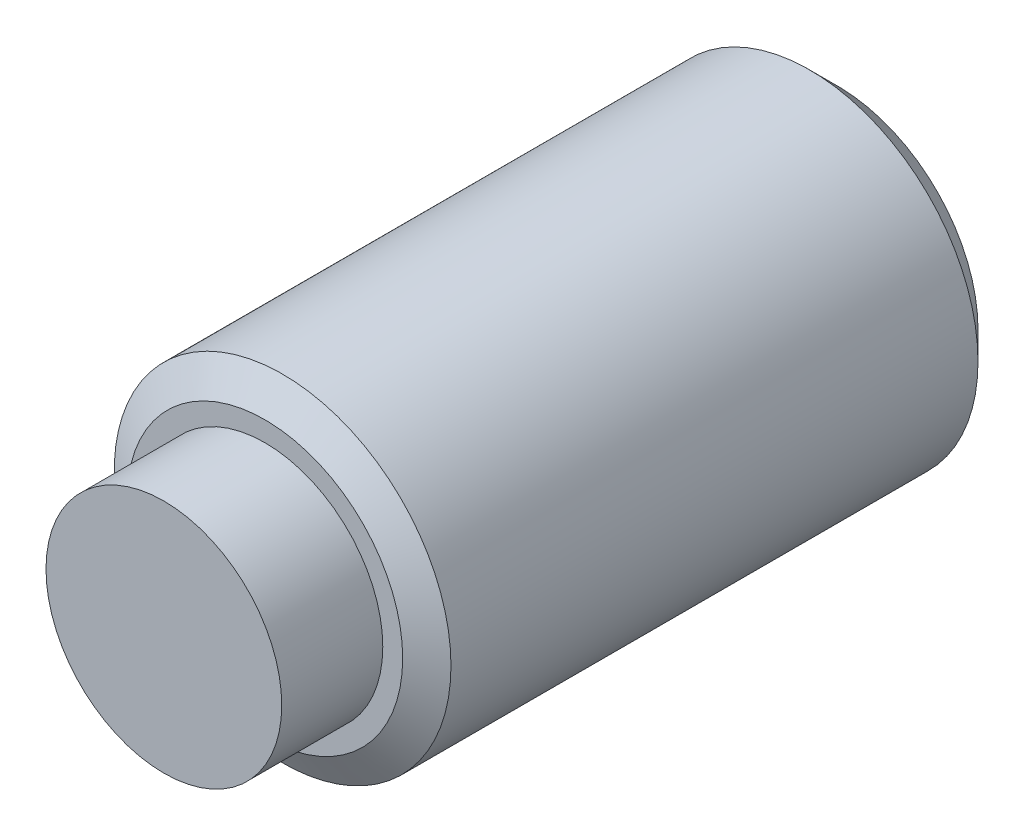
from build123d import *

# Parameters (mm, degrees)
SKETCH1_R       = 2.5
SHANK_DEPTH     = 10
HEX_2_DEPTH     = 1.27
CHAMFER1_SIZE   = 0.413333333
SKETCH8_R       = 6.224979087
SKETCH8_R_2     = 1.75
DOG_POINT_DEPTH = 1.5
CHAMFER2_SIZE   = 0.262466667
CHAMFER2_SIZE2  = 0.454605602


with BuildPart() as part:
    # Sketch1 → Shank (new body)
    with BuildSketch(Plane.XY):
        Circle(SKETCH1_R)
    extrude(amount=SHANK_DEPTH)

    # Sketch7 → Hex 2 (cut)
    with BuildSketch(Plane(origin=(-1.013776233, 4.128685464, 0), x_dir=(-1, 0, 0), z_dir=(0, 0, -1))):
        Polygon((-2.273776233, -4.856146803), (-2.273776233, -3.401224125), (-1.013776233, -2.673762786), (0.246223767, -3.401224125), (0.246223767, -4.856146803), (-1.013776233, -5.583608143), align=None)
    extrude(amount=-HEX_2_DEPTH, mode=Mode.SUBTRACT)

    # Chamfer1
    chamfer1_edges = [part.edges().sort_by_distance(p)[0] for p in [
        (-2.5, 0, 0),
    ]]
    chamfer(chamfer1_edges, length=CHAMFER1_SIZE)

    # Sketch8 → Dog Point (cut)
    with BuildSketch(Plane.XY.offset(10)):
        Circle(SKETCH8_R)
        Circle(SKETCH8_R_2, mode=Mode.SUBTRACT)
    extrude(amount=-DOG_POINT_DEPTH, mode=Mode.SUBTRACT)

    # Chamfer2
    chamfer2_edges = [part.edges().sort_by_distance(p)[0] for p in [
        (-2.5, 0, 8.5),
    ]]
    chamfer2_side = [part.faces().sort_by_distance(p)[0] for p in [
        (-2.5, 0, 4.456666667),
    ]]
    chamfer(chamfer2_edges, length=CHAMFER2_SIZE, length2=CHAMFER2_SIZE2, reference=chamfer2_side[0])


solid = part.part
